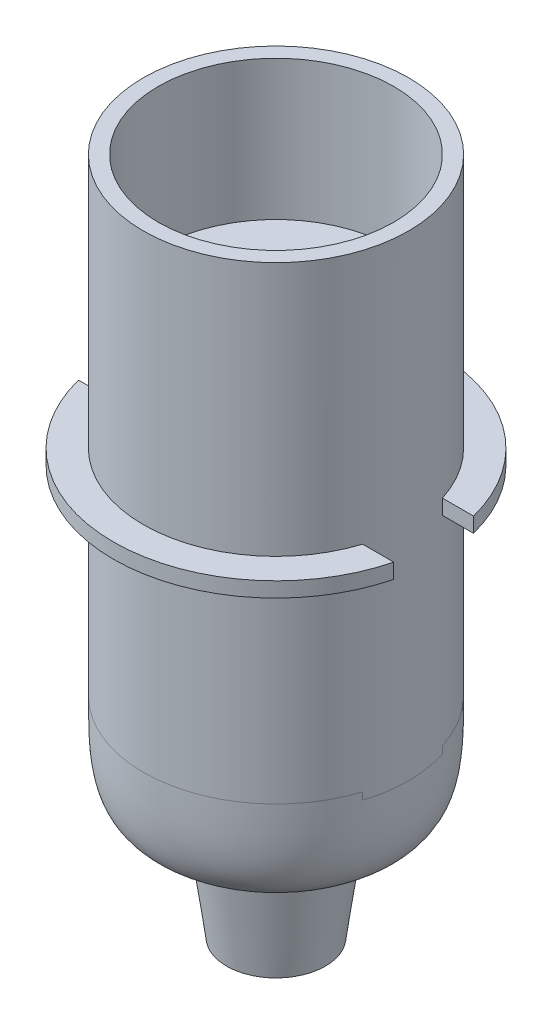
ISO-10303-21;
HEADER;
FILE_DESCRIPTION(('STEP AP214'),'2;1');
FILE_NAME('part.step','',(''),(''),'','','');
FILE_SCHEMA(('AUTOMOTIVE_DESIGN { 1 0 10303 214 1 1 1 1 }'));
ENDSEC;
DATA;
#1=APPLICATION_CONTEXT('core data for automotive mechanical design processes');
#2=APPLICATION_PROTOCOL_DEFINITION('international standard','automotive_design',2000,#1);
#3=PRODUCT_CONTEXT('',#1,'mechanical');
#4=PRODUCT('Part','Part','',(#3));
#5=PRODUCT_RELATED_PRODUCT_CATEGORY('part','',(#4));
#6=PRODUCT_DEFINITION_FORMATION('','',#4);
#7=PRODUCT_DEFINITION_CONTEXT('part definition',#1,'design');
#8=PRODUCT_DEFINITION('design','',#6,#7);
#9=PRODUCT_DEFINITION_SHAPE('','',#8);
#10=(LENGTH_UNIT() NAMED_UNIT(*) SI_UNIT(.MILLI.,.METRE.));
#11=(NAMED_UNIT(*) PLANE_ANGLE_UNIT() SI_UNIT($,.RADIAN.));
#12=(NAMED_UNIT(*) SI_UNIT($,.STERADIAN.) SOLID_ANGLE_UNIT());
#13=UNCERTAINTY_MEASURE_WITH_UNIT(LENGTH_MEASURE(1.E-05),#10,'distance_accuracy_value','');
#14=(GEOMETRIC_REPRESENTATION_CONTEXT(3) GLOBAL_UNCERTAINTY_ASSIGNED_CONTEXT((#13)) GLOBAL_UNIT_ASSIGNED_CONTEXT((#10,
#11,#12)) REPRESENTATION_CONTEXT('',''));
#15=CARTESIAN_POINT('',(0.,0.,0.));
#16=DIRECTION('',(0.,0.,1.));
#17=DIRECTION('',(1.,0.,0.));
#18=AXIS2_PLACEMENT_3D('',#15,#16,#17);
#19=CARTESIAN_POINT('',(8.15,0.,0.));
#20=CARTESIAN_POINT('',(13.2116084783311,0.0241383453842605,0.));
#21=CARTESIAN_POINT('',(13.307154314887,4.13008008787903,0.));
#22=CARTESIAN_POINT('',(13.3,10.,0.));
#23=B_SPLINE_CURVE_WITH_KNOTS('',3,(#19,#20,#21,#22),.UNSPECIFIED.,.F.,.F.,(4,4),(0.,1.),.UNSPECIFIED.);
#24=CARTESIAN_POINT('',(0.,68.8462678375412,0.));
#25=DIRECTION('',(0.,1.,0.));
#26=AXIS1_PLACEMENT('',#24,#25);
#27=SURFACE_OF_REVOLUTION('',#23,#26);
#28=CARTESIAN_POINT('',(0.,0.,0.));
#29=DIRECTION('',(0.,1.,0.));
#30=DIRECTION('',(0.,0.,1.));
#31=AXIS2_PLACEMENT_3D('',#28,#29,#30);
#32=CIRCLE('',#31,8.15);
#33=CARTESIAN_POINT('',(0.,0.,8.15));
#34=VERTEX_POINT('',#33);
#35=EDGE_CURVE('E313',#34,#34,#32,.T.);
#36=ORIENTED_EDGE('',*,*,#35,.T.);
#37=EDGE_LOOP('',(#36));
#38=FACE_BOUND('',#37,.T.);
#39=CARTESIAN_POINT('',(-12.6842421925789,10.,4.00000000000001));
#40=CARTESIAN_POINT('',(-12.6842778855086,9.96928909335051,4.00001125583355));
#41=CARTESIAN_POINT('',(-12.6843109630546,9.93857818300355,4.00002168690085));
#42=CARTESIAN_POINT('',(-12.6843703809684,9.87725390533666,4.00004042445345));
#43=CARTESIAN_POINT('',(-12.6843967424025,9.846640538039,4.00004873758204));
#44=CARTESIAN_POINT('',(-12.6844413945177,9.78551201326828,4.00006281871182));
#45=CARTESIAN_POINT('',(-12.6844597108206,9.75499685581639,4.00006859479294));
#46=CARTESIAN_POINT('',(-12.6844869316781,9.6940654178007,4.00007717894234));
#47=CARTESIAN_POINT('',(-12.6844958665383,9.66364913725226,4.00007999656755));
#48=CARTESIAN_POINT('',(-12.6845029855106,9.60291612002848,4.00008224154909));
#49=CARTESIAN_POINT('',(-12.6845012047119,9.5725993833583,4.00008167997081));
#50=CARTESIAN_POINT('',(-12.6844855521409,9.51206612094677,4.00007674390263));
#51=CARTESIAN_POINT('',(-12.684471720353,9.48184959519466,4.00007238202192));
#52=CARTESIAN_POINT('',(-12.6844306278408,9.42151742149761,4.0000594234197));
#53=CARTESIAN_POINT('',(-12.6844034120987,9.39140177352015,4.00005084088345));
#54=CARTESIAN_POINT('',(-12.6843342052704,9.33127202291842,4.00002901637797));
#55=CARTESIAN_POINT('',(-12.6842922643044,9.30125792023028,4.00001579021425));
#56=CARTESIAN_POINT('',(-12.6842421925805,9.27124383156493,4.00000000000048));
#57=B_SPLINE_CURVE_WITH_KNOTS('',3,(#39,#40,#41,#42,#43,#44,#45,#46,#47,#48,#49,#50,#51,#52,#53,
#54,#55,#56),.UNSPECIFIED.,.F.,.F.,(4,2,2,2,2,2,2,2,4),(0.,0.0921327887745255,0.183972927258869,
0.27551841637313,0.366767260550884,0.457717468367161,0.548367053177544,0.638714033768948,
0.728756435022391),.UNSPECIFIED.);
#58=CARTESIAN_POINT('',(-12.6842421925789,10.,4.));
#59=VERTEX_POINT('',#58);
#60=CARTESIAN_POINT('',(-12.6842421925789,9.27124383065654,4.));
#61=VERTEX_POINT('',#60);
#62=EDGE_CURVE('E175',#59,#61,#57,.T.);
#63=ORIENTED_EDGE('',*,*,#62,.T.);
#64=CARTESIAN_POINT('',(0.,9.27124383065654,0.));
#65=DIRECTION('',(0.,1.,0.));
#66=DIRECTION('',(0.,0.,1.));
#67=AXIS2_PLACEMENT_3D('',#64,#65,#66);
#68=CIRCLE('',#67,13.3);
#69=CARTESIAN_POINT('',(-12.684242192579,9.27124383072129,-4.));
#70=VERTEX_POINT('',#69);
#71=EDGE_CURVE('E171',#70,#61,#68,.T.);
#72=ORIENTED_EDGE('',*,*,#71,.F.);
#73=CARTESIAN_POINT('',(-12.6842421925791,9.27124383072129,-4.));
#74=CARTESIAN_POINT('',(-12.6842922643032,9.30125791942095,-4.00001579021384));
#75=CARTESIAN_POINT('',(-12.6843342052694,9.33127202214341,-4.00002901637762));
#76=CARTESIAN_POINT('',(-12.684403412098,9.39140177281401,-4.0000508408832));
#77=CARTESIAN_POINT('',(-12.6844306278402,9.42151742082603,-4.00005942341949));
#78=CARTESIAN_POINT('',(-12.6844717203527,9.48184959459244,-4.00007238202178));
#79=CARTESIAN_POINT('',(-12.6844855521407,9.51206612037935,-4.00007674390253));
#80=CARTESIAN_POINT('',(-12.6845012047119,9.57259938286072,-4.00008167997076));
#81=CARTESIAN_POINT('',(-12.6845029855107,9.60291611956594,-4.00008224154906));
#82=CARTESIAN_POINT('',(-12.6844958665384,9.66364913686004,-4.00007999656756));
#83=CARTESIAN_POINT('',(-12.6844869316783,9.69406541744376,-4.00007717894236));
#84=CARTESIAN_POINT('',(-12.6844597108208,9.75499685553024,-4.00006859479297));
#85=CARTESIAN_POINT('',(-12.6844413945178,9.78551201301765,-4.00006281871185));
#86=CARTESIAN_POINT('',(-12.6843967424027,9.84664053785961,-4.00004873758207));
#87=CARTESIAN_POINT('',(-12.6843703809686,9.87725390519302,-4.00004042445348));
#88=CARTESIAN_POINT('',(-12.6843109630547,9.93857818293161,-4.00002168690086));
#89=CARTESIAN_POINT('',(-12.6842778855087,9.96928909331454,-4.00001125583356));
#90=CARTESIAN_POINT('',(-12.6842421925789,10.,-4.));
#91=B_SPLINE_CURVE_WITH_KNOTS('',3,(#73,#74,#75,#76,#77,#78,#79,#80,#81,#82,#83,#84,#85,#86,#87,
#88,#89,#90),.UNSPECIFIED.,.F.,.F.,(4,2,2,2,2,2,2,2,4),(0.,0.0900424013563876,0.180389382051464,
0.271038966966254,0.361989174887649,0.453238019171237,0.544783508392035,0.636623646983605,
0.728756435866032),.UNSPECIFIED.);
#92=CARTESIAN_POINT('',(-12.6842421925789,10.,-4.));
#93=VERTEX_POINT('',#92);
#94=EDGE_CURVE('E52',#93,#70,#91,.F.);
#95=ORIENTED_EDGE('',*,*,#94,.F.);
#96=CARTESIAN_POINT('',(0.,10.,0.));
#97=DIRECTION('',(0.,1.,0.));
#98=DIRECTION('',(0.,0.,1.));
#99=AXIS2_PLACEMENT_3D('',#96,#97,#98);
#100=CIRCLE('',#99,13.3);
#101=CARTESIAN_POINT('',(12.6842421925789,10.,-4.));
#102=VERTEX_POINT('',#101);
#103=EDGE_CURVE('E44',#102,#93,#100,.T.);
#104=ORIENTED_EDGE('',*,*,#103,.F.);
#105=CARTESIAN_POINT('',(12.6842421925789,10.,-4.));
#106=CARTESIAN_POINT('',(12.6842778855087,9.96928909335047,-4.00001125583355));
#107=CARTESIAN_POINT('',(12.6843109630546,9.93857818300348,-4.00002168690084));
#108=CARTESIAN_POINT('',(12.6843703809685,9.87725390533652,-4.00004042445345));
#109=CARTESIAN_POINT('',(12.6843967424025,9.84664053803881,-4.00004873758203));
#110=CARTESIAN_POINT('',(12.6844413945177,9.78551201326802,-4.00006281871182));
#111=CARTESIAN_POINT('',(12.6844597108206,9.75499685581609,-4.00006859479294));
#112=CARTESIAN_POINT('',(12.6844869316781,9.69406541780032,-4.00007717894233));
#113=CARTESIAN_POINT('',(12.6844958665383,9.66364913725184,-4.00007999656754));
#114=CARTESIAN_POINT('',(12.6845029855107,9.60291612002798,-4.00008224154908));
#115=CARTESIAN_POINT('',(12.6845012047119,9.57259938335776,-4.0000816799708));
#116=CARTESIAN_POINT('',(12.6844855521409,9.51206612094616,-4.00007674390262));
#117=CARTESIAN_POINT('',(12.684471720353,9.48184959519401,-4.00007238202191));
#118=CARTESIAN_POINT('',(12.6844306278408,9.42151742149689,-4.00005942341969));
#119=CARTESIAN_POINT('',(12.6844034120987,9.39140177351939,-4.00005084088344));
#120=CARTESIAN_POINT('',(12.6843342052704,9.33127202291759,-4.00002901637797));
#121=CARTESIAN_POINT('',(12.6842922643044,9.30125792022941,-4.00001579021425));
#122=CARTESIAN_POINT('',(12.6842421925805,9.27124383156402,-4.00000000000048));
#123=B_SPLINE_CURVE_WITH_KNOTS('',3,(#105,#106,#107,#108,#109,#110,#111,#112,#113,#114,#115,
#116,#117,#118,#119,#120,#121,#122),.UNSPECIFIED.,.F.,.F.,(4,2,2,2,2,2,2,2,4),(0.,
0.0921327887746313,0.183972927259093,0.275518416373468,0.366767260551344,0.457717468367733,
0.548367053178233,0.638714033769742,0.728756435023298),.UNSPECIFIED.);
#124=CARTESIAN_POINT('',(12.6842421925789,9.27124383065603,-4.));
#125=VERTEX_POINT('',#124);
#126=EDGE_CURVE('E197',#102,#125,#123,.T.);
#127=ORIENTED_EDGE('',*,*,#126,.T.);
#128=CARTESIAN_POINT('',(0.,9.27124383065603,0.));
#129=DIRECTION('',(0.,1.,0.));
#130=DIRECTION('',(0.,0.,1.));
#131=AXIS2_PLACEMENT_3D('',#128,#129,#130);
#132=CIRCLE('',#131,13.3);
#133=CARTESIAN_POINT('',(12.6842421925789,9.27124383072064,4.));
#134=VERTEX_POINT('',#133);
#135=EDGE_CURVE('E198',#134,#125,#132,.T.);
#136=ORIENTED_EDGE('',*,*,#135,.F.);
#137=CARTESIAN_POINT('',(12.6842421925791,9.27124383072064,4.));
#138=CARTESIAN_POINT('',(12.6842922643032,9.30125791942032,4.00001579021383));
#139=CARTESIAN_POINT('',(12.6843342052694,9.33127202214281,4.00002901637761));
#140=CARTESIAN_POINT('',(12.684403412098,9.39140177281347,4.00005084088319));
#141=CARTESIAN_POINT('',(12.6844306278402,9.42151742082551,4.00005942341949));
#142=CARTESIAN_POINT('',(12.6844717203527,9.48184959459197,4.00007238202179));
#143=CARTESIAN_POINT('',(12.6844855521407,9.51206612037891,4.00007674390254));
#144=CARTESIAN_POINT('',(12.6845012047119,9.57259938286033,4.00008167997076));
#145=CARTESIAN_POINT('',(12.6845029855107,9.60291611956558,4.00008224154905));
#146=CARTESIAN_POINT('',(12.6844958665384,9.66364913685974,4.00007999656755));
#147=CARTESIAN_POINT('',(12.6844869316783,9.69406541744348,4.00007717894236));
#148=CARTESIAN_POINT('',(12.6844597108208,9.75499685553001,4.00006859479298));
#149=CARTESIAN_POINT('',(12.6844413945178,9.78551201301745,4.00006281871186));
#150=CARTESIAN_POINT('',(12.6843967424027,9.84664053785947,4.00004873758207));
#151=CARTESIAN_POINT('',(12.6843703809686,9.8772539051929,4.00004042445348));
#152=CARTESIAN_POINT('',(12.6843109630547,9.93857818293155,4.00002168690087));
#153=CARTESIAN_POINT('',(12.6842778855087,9.96928909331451,4.00001125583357));
#154=CARTESIAN_POINT('',(12.6842421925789,10.,4.));
#155=B_SPLINE_CURVE_WITH_KNOTS('',3,(#137,#138,#139,#140,#141,#142,#143,#144,#145,#146,#147,
#148,#149,#150,#151,#152,#153,#154),.UNSPECIFIED.,.F.,.F.,(4,2,2,2,2,2,2,2,4),(0.,
0.0900424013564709,0.180389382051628,0.271038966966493,0.361989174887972,0.453238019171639,
0.544783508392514,0.636623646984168,0.728756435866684),.UNSPECIFIED.);
#156=CARTESIAN_POINT('',(12.6842421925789,10.,4.));
#157=VERTEX_POINT('',#156);
#158=EDGE_CURVE('E191',#157,#134,#155,.F.);
#159=ORIENTED_EDGE('',*,*,#158,.F.);
#160=EDGE_CURVE('E149',#59,#157,#100,.T.);
#161=ORIENTED_EDGE('',*,*,#160,.F.);
#162=EDGE_LOOP('',(#63,#72,#95,#104,#127,#136,#159,#161));
#163=FACE_BOUND('',#162,.T.);
#164=ADVANCED_FACE('F32',(#38,#163),#27,.T.);
#165=CARTESIAN_POINT('',(16.3,30.,0.));
#166=DIRECTION('',(0.,1.,0.));
#167=DIRECTION('',(0.,0.,1.));
#168=AXIS2_PLACEMENT_3D('',#165,#166,#167);
#169=PLANE('',#168);
#170=DIRECTION('',(-1.,0.,0.));
#171=VECTOR('',#170,1.);
#172=CARTESIAN_POINT('',(16.3,30.,4.));
#173=LINE('',#172,#171);
#174=CARTESIAN_POINT('',(-12.6842421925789,30.,4.));
#175=VERTEX_POINT('',#174);
#176=CARTESIAN_POINT('',(-15.8015821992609,30.,4.));
#177=VERTEX_POINT('',#176);
#178=EDGE_CURVE('E176',#175,#177,#173,.T.);
#179=ORIENTED_EDGE('',*,*,#178,.F.);
#180=CARTESIAN_POINT('',(0.,30.,0.));
#181=DIRECTION('',(0.,1.,0.));
#182=DIRECTION('',(0.,0.,1.));
#183=AXIS2_PLACEMENT_3D('',#180,#181,#182);
#184=CIRCLE('',#183,13.3);
#185=CARTESIAN_POINT('',(12.6842421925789,30.,4.));
#186=VERTEX_POINT('',#185);
#187=EDGE_CURVE('E150',#175,#186,#184,.T.);
#188=ORIENTED_EDGE('',*,*,#187,.T.);
#189=DIRECTION('',(-1.,0.,0.));
#190=VECTOR('',#189,1.);
#191=CARTESIAN_POINT('',(16.3,30.,4.));
#192=LINE('',#191,#190);
#193=CARTESIAN_POINT('',(15.8015821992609,30.,4.));
#194=VERTEX_POINT('',#193);
#195=EDGE_CURVE('E188',#194,#186,#192,.T.);
#196=ORIENTED_EDGE('',*,*,#195,.F.);
#197=CARTESIAN_POINT('',(0.,30.,0.));
#198=DIRECTION('',(0.,1.,0.));
#199=DIRECTION('',(0.,0.,1.));
#200=AXIS2_PLACEMENT_3D('',#197,#198,#199);
#201=CIRCLE('',#200,16.3);
#202=EDGE_CURVE('E283',#177,#194,#201,.T.);
#203=ORIENTED_EDGE('',*,*,#202,.F.);
#204=EDGE_LOOP('',(#179,#188,#196,#203));
#205=FACE_BOUND('',#204,.T.);
#206=ADVANCED_FACE('F281',(#205),#169,.F.);
#207=DIRECTION('',(1.,0.,0.));
#208=VECTOR('',#207,1.);
#209=CARTESIAN_POINT('',(16.3,30.,-4.));
#210=LINE('',#209,#208);
#211=CARTESIAN_POINT('',(-15.8015821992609,30.,-4.));
#212=VERTEX_POINT('',#211);
#213=CARTESIAN_POINT('',(-12.684242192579,30.,-4.));
#214=VERTEX_POINT('',#213);
#215=EDGE_CURVE('E126',#212,#214,#210,.T.);
#216=ORIENTED_EDGE('',*,*,#215,.F.);
#217=CARTESIAN_POINT('',(15.8015821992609,30.,-4.));
#218=VERTEX_POINT('',#217);
#219=EDGE_CURVE('E153',#218,#212,#201,.T.);
#220=ORIENTED_EDGE('',*,*,#219,.F.);
#221=DIRECTION('',(1.,0.,0.));
#222=VECTOR('',#221,1.);
#223=CARTESIAN_POINT('',(16.3,30.,-4.));
#224=LINE('',#223,#222);
#225=CARTESIAN_POINT('',(12.6842421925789,30.,-4.));
#226=VERTEX_POINT('',#225);
#227=EDGE_CURVE('E148',#226,#218,#224,.T.);
#228=ORIENTED_EDGE('',*,*,#227,.F.);
#229=EDGE_CURVE('E141',#226,#214,#184,.T.);
#230=ORIENTED_EDGE('',*,*,#229,.T.);
#231=EDGE_LOOP('',(#216,#220,#228,#230));
#232=FACE_BOUND('',#231,.T.);
#233=ADVANCED_FACE('F147',(#232),#169,.F.);
#234=CARTESIAN_POINT('',(0.,68.8462678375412,0.));
#235=DIRECTION('',(0.,1.,0.));
#236=DIRECTION('',(0.,0.,1.));
#237=AXIS2_PLACEMENT_3D('',#234,#235,#236);
#238=CYLINDRICAL_SURFACE('',#237,16.3);
#239=DIRECTION('',(0.,1.,0.));
#240=VECTOR('',#239,1.);
#241=CARTESIAN_POINT('',(-15.8015821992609,68.8462678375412,4.));
#242=LINE('',#241,#240);
#243=CARTESIAN_POINT('',(-15.8015821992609,31.5,4.));
#244=VERTEX_POINT('',#243);
#245=EDGE_CURVE('E265',#177,#244,#242,.T.);
#246=ORIENTED_EDGE('',*,*,#245,.F.);
#247=ORIENTED_EDGE('',*,*,#202,.T.);
#248=DIRECTION('',(0.,1.,0.));
#249=VECTOR('',#248,1.);
#250=CARTESIAN_POINT('',(15.8015821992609,68.8462678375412,4.));
#251=LINE('',#250,#249);
#252=CARTESIAN_POINT('',(15.8015821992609,31.5,4.));
#253=VERTEX_POINT('',#252);
#254=EDGE_CURVE('E185',#253,#194,#251,.F.);
#255=ORIENTED_EDGE('',*,*,#254,.F.);
#256=CARTESIAN_POINT('',(0.,31.5,0.));
#257=DIRECTION('',(0.,1.,0.));
#258=DIRECTION('',(0.,0.,1.));
#259=AXIS2_PLACEMENT_3D('',#256,#257,#258);
#260=CIRCLE('',#259,16.3);
#261=EDGE_CURVE('E292',#244,#253,#260,.T.);
#262=ORIENTED_EDGE('',*,*,#261,.F.);
#263=EDGE_LOOP('',(#246,#247,#255,#262));
#264=FACE_BOUND('',#263,.T.);
#265=ADVANCED_FACE('F351',(#264),#238,.T.);
#266=DIRECTION('',(0.,1.,0.));
#267=VECTOR('',#266,1.);
#268=CARTESIAN_POINT('',(-15.8015821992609,68.8462678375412,-4.));
#269=LINE('',#268,#267);
#270=CARTESIAN_POINT('',(-15.8015821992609,31.5,-4.));
#271=VERTEX_POINT('',#270);
#272=EDGE_CURVE('E129',#271,#212,#269,.F.);
#273=ORIENTED_EDGE('',*,*,#272,.F.);
#274=CARTESIAN_POINT('',(15.8015821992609,31.5,-4.));
#275=VERTEX_POINT('',#274);
#276=EDGE_CURVE('E294',#275,#271,#260,.T.);
#277=ORIENTED_EDGE('',*,*,#276,.F.);
#278=DIRECTION('',(0.,1.,0.));
#279=VECTOR('',#278,1.);
#280=CARTESIAN_POINT('',(15.8015821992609,68.8462678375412,-4.));
#281=LINE('',#280,#279);
#282=EDGE_CURVE('E194',#218,#275,#281,.T.);
#283=ORIENTED_EDGE('',*,*,#282,.F.);
#284=ORIENTED_EDGE('',*,*,#219,.T.);
#285=EDGE_LOOP('',(#273,#277,#283,#284));
#286=FACE_BOUND('',#285,.T.);
#287=ADVANCED_FACE('F353',(#286),#238,.T.);
#288=CARTESIAN_POINT('',(13.3,31.5,0.));
#289=DIRECTION('',(0.,-1.,0.));
#290=DIRECTION('',(0.,0.,-1.));
#291=AXIS2_PLACEMENT_3D('',#288,#289,#290);
#292=PLANE('',#291);
#293=DIRECTION('',(1.,0.,0.));
#294=VECTOR('',#293,1.);
#295=CARTESIAN_POINT('',(13.3,31.5,4.));
#296=LINE('',#295,#294);
#297=CARTESIAN_POINT('',(-12.6842421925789,31.5,4.));
#298=VERTEX_POINT('',#297);
#299=EDGE_CURVE('E249',#244,#298,#296,.T.);
#300=ORIENTED_EDGE('',*,*,#299,.F.);
#301=ORIENTED_EDGE('',*,*,#261,.T.);
#302=DIRECTION('',(1.,0.,0.));
#303=VECTOR('',#302,1.);
#304=CARTESIAN_POINT('',(13.3,31.5,4.));
#305=LINE('',#304,#303);
#306=CARTESIAN_POINT('',(12.6842421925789,31.5,4.));
#307=VERTEX_POINT('',#306);
#308=EDGE_CURVE('E182',#307,#253,#305,.T.);
#309=ORIENTED_EDGE('',*,*,#308,.F.);
#310=CARTESIAN_POINT('',(0.,31.5,0.));
#311=DIRECTION('',(0.,1.,0.));
#312=DIRECTION('',(0.,0.,1.));
#313=AXIS2_PLACEMENT_3D('',#310,#311,#312);
#314=CIRCLE('',#313,13.3);
#315=EDGE_CURVE('E285',#298,#307,#314,.T.);
#316=ORIENTED_EDGE('',*,*,#315,.F.);
#317=EDGE_LOOP('',(#300,#301,#309,#316));
#318=FACE_BOUND('',#317,.T.);
#319=ADVANCED_FACE('F234',(#318),#292,.F.);
#320=DIRECTION('',(-1.,0.,0.));
#321=VECTOR('',#320,1.);
#322=CARTESIAN_POINT('',(13.3,31.5,-4.));
#323=LINE('',#322,#321);
#324=CARTESIAN_POINT('',(-12.6842421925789,31.5,-4.));
#325=VERTEX_POINT('',#324);
#326=EDGE_CURVE('E273',#325,#271,#323,.T.);
#327=ORIENTED_EDGE('',*,*,#326,.F.);
#328=CARTESIAN_POINT('',(12.6842421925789,31.5,-4.));
#329=VERTEX_POINT('',#328);
#330=EDGE_CURVE('E143',#329,#325,#314,.T.);
#331=ORIENTED_EDGE('',*,*,#330,.F.);
#332=DIRECTION('',(-1.,0.,0.));
#333=VECTOR('',#332,1.);
#334=CARTESIAN_POINT('',(13.3,31.5,-4.));
#335=LINE('',#334,#333);
#336=EDGE_CURVE('E192',#275,#329,#335,.T.);
#337=ORIENTED_EDGE('',*,*,#336,.F.);
#338=ORIENTED_EDGE('',*,*,#276,.T.);
#339=EDGE_LOOP('',(#327,#331,#337,#338));
#340=FACE_BOUND('',#339,.T.);
#341=ADVANCED_FACE('F336',(#340),#292,.F.);
#342=CARTESIAN_POINT('',(8.15,0.,0.));
#343=DIRECTION('',(0.,1.,0.));
#344=DIRECTION('',(0.,0.,1.));
#345=AXIS2_PLACEMENT_3D('',#342,#343,#344);
#346=PLANE('',#345);
#347=ORIENTED_EDGE('',*,*,#35,.F.);
#348=EDGE_LOOP('',(#347));
#349=FACE_BOUND('',#348,.T.);
#350=CARTESIAN_POINT('',(0.,0.,0.));
#351=DIRECTION('',(0.,1.,0.));
#352=DIRECTION('',(0.,0.,1.));
#353=AXIS2_PLACEMENT_3D('',#350,#351,#352);
#354=CIRCLE('',#353,6.5);
#355=CARTESIAN_POINT('',(0.,0.,6.5));
#356=VERTEX_POINT('',#355);
#357=EDGE_CURVE('E11',#356,#356,#354,.F.);
#358=ORIENTED_EDGE('',*,*,#357,.F.);
#359=EDGE_LOOP('',(#358));
#360=FACE_BOUND('',#359,.T.);
#361=ADVANCED_FACE('F231',(#349,#360),#346,.F.);
#362=CARTESIAN_POINT('',(0.,68.8462678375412,0.));
#363=DIRECTION('',(0.,1.,0.));
#364=DIRECTION('',(0.,0.,1.));
#365=AXIS2_PLACEMENT_3D('',#362,#363,#364);
#366=CYLINDRICAL_SURFACE('',#365,13.3);
#367=ORIENTED_EDGE('',*,*,#187,.F.);
#368=DIRECTION('',(0.,-1.,0.));
#369=VECTOR('',#368,1.);
#370=CARTESIAN_POINT('',(-12.6842421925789,35.,4.));
#371=LINE('',#370,#369);
#372=EDGE_CURVE('E144',#298,#175,#371,.T.);
#373=ORIENTED_EDGE('',*,*,#372,.F.);
#374=ORIENTED_EDGE('',*,*,#315,.T.);
#375=DIRECTION('',(0.,-1.,0.));
#376=VECTOR('',#375,1.);
#377=CARTESIAN_POINT('',(12.6842421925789,35.,4.));
#378=LINE('',#377,#376);
#379=EDGE_CURVE('E174',#307,#186,#378,.T.);
#380=ORIENTED_EDGE('',*,*,#379,.T.);
#381=EDGE_LOOP('',(#367,#373,#374,#380));
#382=FACE_BOUND('',#381,.T.);
#383=DIRECTION('',(0.,-1.,0.));
#384=VECTOR('',#383,1.);
#385=CARTESIAN_POINT('',(-12.684242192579,35.,-4.));
#386=LINE('',#385,#384);
#387=EDGE_CURVE('E61',#325,#214,#386,.T.);
#388=ORIENTED_EDGE('',*,*,#387,.T.);
#389=ORIENTED_EDGE('',*,*,#229,.F.);
#390=DIRECTION('',(0.,-1.,0.));
#391=VECTOR('',#390,1.);
#392=CARTESIAN_POINT('',(12.6842421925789,35.,-4.));
#393=LINE('',#392,#391);
#394=EDGE_CURVE('E180',#329,#226,#393,.T.);
#395=ORIENTED_EDGE('',*,*,#394,.F.);
#396=ORIENTED_EDGE('',*,*,#330,.T.);
#397=EDGE_LOOP('',(#388,#389,#395,#396));
#398=FACE_BOUND('',#397,.T.);
#399=ORIENTED_EDGE('',*,*,#103,.T.);
#400=ORIENTED_EDGE('',*,*,#94,.T.);
#401=ORIENTED_EDGE('',*,*,#71,.T.);
#402=ORIENTED_EDGE('',*,*,#62,.F.);
#403=ORIENTED_EDGE('',*,*,#160,.T.);
#404=ORIENTED_EDGE('',*,*,#158,.T.);
#405=ORIENTED_EDGE('',*,*,#135,.T.);
#406=ORIENTED_EDGE('',*,*,#126,.F.);
#407=EDGE_LOOP('',(#399,#400,#401,#402,#403,#404,#405,#406));
#408=FACE_BOUND('',#407,.T.);
#409=CARTESIAN_POINT('',(0.,57.,0.));
#410=DIRECTION('',(0.,1.,0.));
#411=DIRECTION('',(0.,0.,1.));
#412=AXIS2_PLACEMENT_3D('',#409,#410,#411);
#413=CIRCLE('',#412,13.3);
#414=CARTESIAN_POINT('',(0.,57.,13.3));
#415=VERTEX_POINT('',#414);
#416=EDGE_CURVE('E298',#415,#415,#413,.T.);
#417=ORIENTED_EDGE('',*,*,#416,.F.);
#418=EDGE_LOOP('',(#417));
#419=FACE_BOUND('',#418,.T.);
#420=ADVANCED_FACE('F138',(#382,#398,#408,#419),#366,.T.);
#421=CARTESIAN_POINT('',(11.8,57.,0.));
#422=DIRECTION('',(0.,-1.,0.));
#423=DIRECTION('',(0.,0.,-1.));
#424=AXIS2_PLACEMENT_3D('',#421,#422,#423);
#425=PLANE('',#424);
#426=CARTESIAN_POINT('',(0.,57.,0.));
#427=DIRECTION('',(0.,1.,0.));
#428=DIRECTION('',(0.,0.,1.));
#429=AXIS2_PLACEMENT_3D('',#426,#427,#428);
#430=CIRCLE('',#429,11.8);
#431=CARTESIAN_POINT('',(0.,57.,11.8));
#432=VERTEX_POINT('',#431);
#433=EDGE_CURVE('E301',#432,#432,#430,.T.);
#434=ORIENTED_EDGE('',*,*,#433,.F.);
#435=EDGE_LOOP('',(#434));
#436=FACE_BOUND('',#435,.T.);
#437=ORIENTED_EDGE('',*,*,#416,.T.);
#438=EDGE_LOOP('',(#437));
#439=FACE_BOUND('',#438,.T.);
#440=ADVANCED_FACE('F230',(#436,#439),#425,.F.);
#441=CARTESIAN_POINT('',(0.,68.8462678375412,0.));
#442=DIRECTION('',(0.,1.,0.));
#443=DIRECTION('',(0.,0.,1.));
#444=AXIS2_PLACEMENT_3D('',#441,#442,#443);
#445=CYLINDRICAL_SURFACE('',#444,11.8);
#446=CARTESIAN_POINT('',(0.,43.,0.));
#447=DIRECTION('',(0.,1.,0.));
#448=DIRECTION('',(0.,0.,1.));
#449=AXIS2_PLACEMENT_3D('',#446,#447,#448);
#450=CIRCLE('',#449,11.8);
#451=CARTESIAN_POINT('',(0.,43.,11.8));
#452=VERTEX_POINT('',#451);
#453=EDGE_CURVE('E304',#452,#452,#450,.T.);
#454=ORIENTED_EDGE('',*,*,#453,.F.);
#455=EDGE_LOOP('',(#454));
#456=FACE_BOUND('',#455,.T.);
#457=ORIENTED_EDGE('',*,*,#433,.T.);
#458=EDGE_LOOP('',(#457));
#459=FACE_BOUND('',#458,.T.);
#460=ADVANCED_FACE('F490',(#456,#459),#445,.F.);
#461=CARTESIAN_POINT('',(6.6,43.,0.));
#462=DIRECTION('',(0.,-1.,0.));
#463=DIRECTION('',(0.,0.,-1.));
#464=AXIS2_PLACEMENT_3D('',#461,#462,#463);
#465=PLANE('',#464);
#466=CARTESIAN_POINT('',(0.,43.,0.));
#467=DIRECTION('',(0.,1.,0.));
#468=DIRECTION('',(0.,0.,1.));
#469=AXIS2_PLACEMENT_3D('',#466,#467,#468);
#470=CIRCLE('',#469,6.6);
#471=CARTESIAN_POINT('',(0.,43.,6.6));
#472=VERTEX_POINT('',#471);
#473=EDGE_CURVE('E307',#472,#472,#470,.T.);
#474=ORIENTED_EDGE('',*,*,#473,.F.);
#475=EDGE_LOOP('',(#474));
#476=FACE_BOUND('',#475,.T.);
#477=ORIENTED_EDGE('',*,*,#453,.T.);
#478=EDGE_LOOP('',(#477));
#479=FACE_BOUND('',#478,.T.);
#480=ADVANCED_FACE('F481',(#476,#479),#465,.F.);
#481=CARTESIAN_POINT('',(0.,68.8462678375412,0.));
#482=DIRECTION('',(0.,1.,0.));
#483=DIRECTION('',(0.,0.,1.));
#484=AXIS2_PLACEMENT_3D('',#481,#482,#483);
#485=CYLINDRICAL_SURFACE('',#484,6.6);
#486=CARTESIAN_POINT('',(0.,30.,0.));
#487=DIRECTION('',(0.,1.,0.));
#488=DIRECTION('',(0.,0.,1.));
#489=AXIS2_PLACEMENT_3D('',#486,#487,#488);
#490=CIRCLE('',#489,6.6);
#491=CARTESIAN_POINT('',(0.,30.,6.6));
#492=VERTEX_POINT('',#491);
#493=EDGE_CURVE('E310',#492,#492,#490,.T.);
#494=ORIENTED_EDGE('',*,*,#493,.F.);
#495=EDGE_LOOP('',(#494));
#496=FACE_BOUND('',#495,.T.);
#497=ORIENTED_EDGE('',*,*,#473,.T.);
#498=EDGE_LOOP('',(#497));
#499=FACE_BOUND('',#498,.T.);
#500=ADVANCED_FACE('F473',(#496,#499),#485,.F.);
#501=CARTESIAN_POINT('',(0.,30.,0.));
#502=DIRECTION('',(0.,-1.,0.));
#503=DIRECTION('',(0.,0.,-1.));
#504=AXIS2_PLACEMENT_3D('',#501,#502,#503);
#505=PLANE('',#504);
#506=ORIENTED_EDGE('',*,*,#493,.T.);
#507=EDGE_LOOP('',(#506));
#508=FACE_BOUND('',#507,.T.);
#509=ADVANCED_FACE('F331',(#508),#505,.F.);
#510=CARTESIAN_POINT('',(0.,0.,0.));
#511=DIRECTION('',(0.,1.,0.));
#512=DIRECTION('',(0.,0.,-1.));
#513=AXIS2_PLACEMENT_3D('',#510,#511,#512);
#514=CONICAL_SURFACE('',#513,6.5,0.139626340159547);
#515=CARTESIAN_POINT('',(0.,-11.,0.));
#516=DIRECTION('',(0.,-1.,0.));
#517=DIRECTION('',(0.,0.,-1.));
#518=AXIS2_PLACEMENT_3D('',#515,#516,#517);
#519=CIRCLE('',#518,4.95405081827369);
#520=CARTESIAN_POINT('',(0.,-11.,-4.95405081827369));
#521=VERTEX_POINT('',#520);
#522=EDGE_CURVE('E200',#521,#521,#519,.T.);
#523=ORIENTED_EDGE('',*,*,#522,.F.);
#524=EDGE_LOOP('',(#523));
#525=FACE_BOUND('',#524,.T.);
#526=ORIENTED_EDGE('',*,*,#357,.T.);
#527=EDGE_LOOP('',(#526));
#528=FACE_BOUND('',#527,.T.);
#529=ADVANCED_FACE('F328',(#525,#528),#514,.T.);
#530=CARTESIAN_POINT('',(0.,-11.,0.));
#531=DIRECTION('',(0.,-1.,0.));
#532=DIRECTION('',(0.,0.,-1.));
#533=AXIS2_PLACEMENT_3D('',#530,#531,#532);
#534=PLANE('',#533);
#535=ORIENTED_EDGE('',*,*,#522,.T.);
#536=EDGE_LOOP('',(#535));
#537=FACE_BOUND('',#536,.T.);
#538=ADVANCED_FACE('F326',(#537),#534,.T.);
#539=CARTESIAN_POINT('',(12.6842421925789,35.,4.));
#540=DIRECTION('',(0.,0.,-1.));
#541=DIRECTION('',(-1.,0.,0.));
#542=AXIS2_PLACEMENT_3D('',#539,#540,#541);
#543=PLANE('',#542);
#544=ORIENTED_EDGE('',*,*,#195,.T.);
#545=ORIENTED_EDGE('',*,*,#379,.F.);
#546=ORIENTED_EDGE('',*,*,#308,.T.);
#547=ORIENTED_EDGE('',*,*,#254,.T.);
#548=EDGE_LOOP('',(#544,#545,#546,#547));
#549=FACE_BOUND('',#548,.T.);
#550=ADVANCED_FACE('F288',(#549),#543,.T.);
#551=CARTESIAN_POINT('',(12.6842421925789,35.,-4.));
#552=DIRECTION('',(0.,0.,1.));
#553=DIRECTION('',(1.,0.,0.));
#554=AXIS2_PLACEMENT_3D('',#551,#552,#553);
#555=PLANE('',#554);
#556=ORIENTED_EDGE('',*,*,#227,.T.);
#557=ORIENTED_EDGE('',*,*,#282,.T.);
#558=ORIENTED_EDGE('',*,*,#336,.T.);
#559=ORIENTED_EDGE('',*,*,#394,.T.);
#560=EDGE_LOOP('',(#556,#557,#558,#559));
#561=FACE_BOUND('',#560,.T.);
#562=ADVANCED_FACE('F362',(#561),#555,.T.);
#563=CARTESIAN_POINT('',(-12.6842421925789,35.,-4.));
#564=DIRECTION('',(0.,0.,1.));
#565=DIRECTION('',(1.,0.,0.));
#566=AXIS2_PLACEMENT_3D('',#563,#564,#565);
#567=PLANE('',#566);
#568=ORIENTED_EDGE('',*,*,#215,.T.);
#569=ORIENTED_EDGE('',*,*,#387,.F.);
#570=ORIENTED_EDGE('',*,*,#326,.T.);
#571=ORIENTED_EDGE('',*,*,#272,.T.);
#572=EDGE_LOOP('',(#568,#569,#570,#571));
#573=FACE_BOUND('',#572,.T.);
#574=ADVANCED_FACE('F127',(#573),#567,.T.);
#575=CARTESIAN_POINT('',(-16.4386219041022,35.,4.));
#576=DIRECTION('',(0.,0.,-1.));
#577=DIRECTION('',(-1.,0.,0.));
#578=AXIS2_PLACEMENT_3D('',#575,#576,#577);
#579=PLANE('',#578);
#580=ORIENTED_EDGE('',*,*,#178,.T.);
#581=ORIENTED_EDGE('',*,*,#245,.T.);
#582=ORIENTED_EDGE('',*,*,#299,.T.);
#583=ORIENTED_EDGE('',*,*,#372,.T.);
#584=EDGE_LOOP('',(#580,#581,#582,#583));
#585=FACE_BOUND('',#584,.T.);
#586=ADVANCED_FACE('F276',(#585),#579,.T.);
#587=CLOSED_SHELL('',(#164,#206,#233,#265,#287,#319,#341,#361,#420,#440,#460,#480,#500,#509,
#529,#538,#550,#562,#574,#586));
#588=MANIFOLD_SOLID_BREP('B2',#587);
#589=ADVANCED_BREP_SHAPE_REPRESENTATION('',(#18,#588),#14);
#590=SHAPE_DEFINITION_REPRESENTATION(#9,#589);
ENDSEC;
END-ISO-10303-21;
